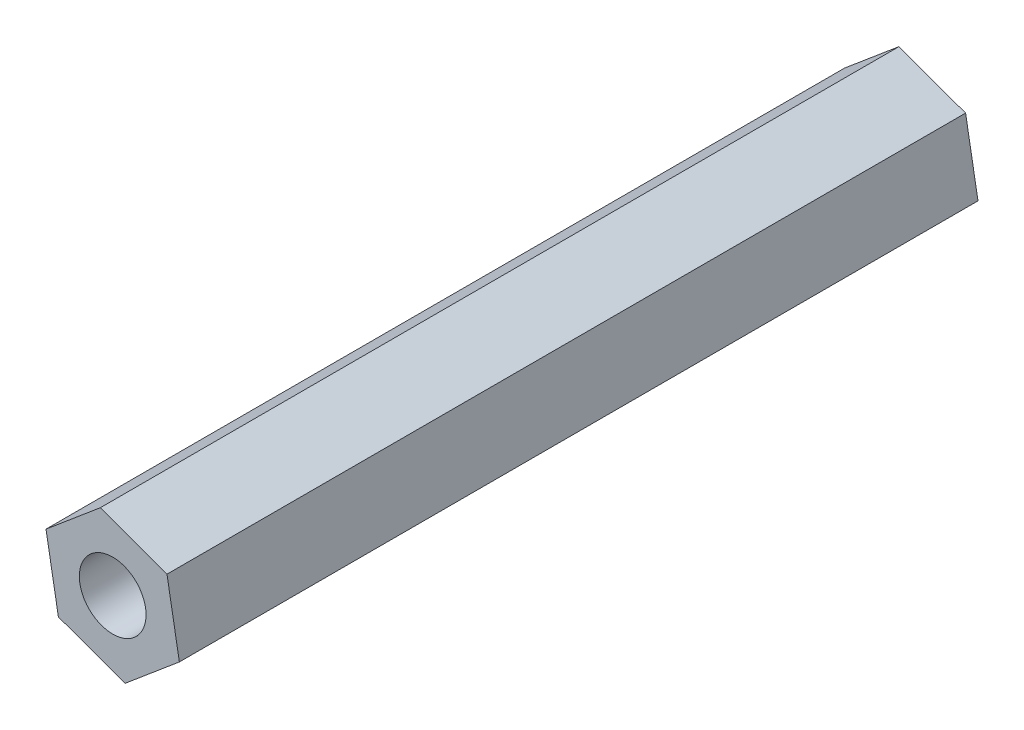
ISO-10303-21;
HEADER;
FILE_DESCRIPTION(('STEP AP214'),'2;1');
FILE_NAME('part.step','',(''),(''),'','','');
FILE_SCHEMA(('AUTOMOTIVE_DESIGN { 1 0 10303 214 1 1 1 1 }'));
ENDSEC;
DATA;
#1=APPLICATION_CONTEXT('core data for automotive mechanical design processes');
#2=APPLICATION_PROTOCOL_DEFINITION('international standard','automotive_design',2000,#1);
#3=PRODUCT_CONTEXT('',#1,'mechanical');
#4=PRODUCT('Part','Part','',(#3));
#5=PRODUCT_RELATED_PRODUCT_CATEGORY('part','',(#4));
#6=PRODUCT_DEFINITION_FORMATION('','',#4);
#7=PRODUCT_DEFINITION_CONTEXT('part definition',#1,'design');
#8=PRODUCT_DEFINITION('design','',#6,#7);
#9=PRODUCT_DEFINITION_SHAPE('','',#8);
#10=(LENGTH_UNIT() NAMED_UNIT(*) SI_UNIT(.MILLI.,.METRE.));
#11=(NAMED_UNIT(*) PLANE_ANGLE_UNIT() SI_UNIT($,.RADIAN.));
#12=(NAMED_UNIT(*) SI_UNIT($,.STERADIAN.) SOLID_ANGLE_UNIT());
#13=UNCERTAINTY_MEASURE_WITH_UNIT(LENGTH_MEASURE(1.E-05),#10,'distance_accuracy_value','');
#14=(GEOMETRIC_REPRESENTATION_CONTEXT(3) GLOBAL_UNCERTAINTY_ASSIGNED_CONTEXT((#13)) GLOBAL_UNIT_ASSIGNED_CONTEXT((#10,
#11,#12)) REPRESENTATION_CONTEXT('',''));
#15=CARTESIAN_POINT('',(0.,0.,0.));
#16=DIRECTION('',(0.,0.,1.));
#17=DIRECTION('',(1.,0.,0.));
#18=AXIS2_PLACEMENT_3D('',#15,#16,#17);
#19=CARTESIAN_POINT('',(0.640676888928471,-3.60975988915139,41.275));
#20=DIRECTION('',(-0.643647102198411,0.765322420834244,0.));
#21=DIRECTION('',(-0.765322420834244,-0.643647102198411,0.));
#22=AXIS2_PLACEMENT_3D('',#19,#20,#21);
#23=PLANE('',#22);
#24=DIRECTION('',(0.765322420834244,0.643647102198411,0.));
#25=VECTOR('',#24,1.);
#26=CARTESIAN_POINT('',(0.640676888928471,-3.60975988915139,0.));
#27=LINE('',#26,#25);
#28=CARTESIAN_POINT('',(0.640676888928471,-3.60975988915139,0.));
#29=VERTEX_POINT('',#28);
#30=CARTESIAN_POINT('',(3.44648221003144,-1.25003748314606,0.));
#31=VERTEX_POINT('',#30);
#32=EDGE_CURVE('E116',#29,#31,#27,.T.);
#33=ORIENTED_EDGE('',*,*,#32,.T.);
#34=DIRECTION('',(0.,0.,-1.));
#35=VECTOR('',#34,1.);
#36=CARTESIAN_POINT('',(3.44648221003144,-1.25003748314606,41.275));
#37=LINE('',#36,#35);
#38=CARTESIAN_POINT('',(3.44648221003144,-1.25003748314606,41.275));
#39=VERTEX_POINT('',#38);
#40=EDGE_CURVE('E11',#39,#31,#37,.T.);
#41=ORIENTED_EDGE('',*,*,#40,.F.);
#42=DIRECTION('',(0.765322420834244,0.643647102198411,0.));
#43=VECTOR('',#42,1.);
#44=CARTESIAN_POINT('',(0.640676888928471,-3.60975988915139,41.275));
#45=LINE('',#44,#43);
#46=CARTESIAN_POINT('',(0.640676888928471,-3.60975988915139,41.275));
#47=VERTEX_POINT('',#46);
#48=EDGE_CURVE('E127',#47,#39,#45,.T.);
#49=ORIENTED_EDGE('',*,*,#48,.F.);
#50=DIRECTION('',(0.,0.,-1.));
#51=VECTOR('',#50,1.);
#52=CARTESIAN_POINT('',(0.640676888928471,-3.60975988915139,41.275));
#53=LINE('',#52,#51);
#54=EDGE_CURVE('E112',#47,#29,#53,.T.);
#55=ORIENTED_EDGE('',*,*,#54,.T.);
#56=EDGE_LOOP('',(#33,#41,#49,#55));
#57=FACE_BOUND('',#56,.T.);
#58=ADVANCED_FACE('F32',(#57),#23,.F.);
#59=CARTESIAN_POINT('',(3.44648221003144,-1.25003748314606,41.275));
#60=DIRECTION('',(-0.984612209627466,-0.174753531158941,0.));
#61=DIRECTION('',(0.174753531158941,-0.984612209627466,0.));
#62=AXIS2_PLACEMENT_3D('',#59,#60,#61);
#63=PLANE('',#62);
#64=DIRECTION('',(-0.174753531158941,0.984612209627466,0.));
#65=VECTOR('',#64,1.);
#66=CARTESIAN_POINT('',(3.44648221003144,-1.25003748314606,0.));
#67=LINE('',#66,#65);
#68=CARTESIAN_POINT('',(2.80580532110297,2.35972240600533,0.));
#69=VERTEX_POINT('',#68);
#70=EDGE_CURVE('E119',#31,#69,#67,.T.);
#71=ORIENTED_EDGE('',*,*,#70,.T.);
#72=DIRECTION('',(0.,0.,-1.));
#73=VECTOR('',#72,1.);
#74=CARTESIAN_POINT('',(2.80580532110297,2.35972240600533,41.275));
#75=LINE('',#74,#73);
#76=CARTESIAN_POINT('',(2.80580532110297,2.35972240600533,41.275));
#77=VERTEX_POINT('',#76);
#78=EDGE_CURVE('E40',#77,#69,#75,.T.);
#79=ORIENTED_EDGE('',*,*,#78,.F.);
#80=DIRECTION('',(-0.174753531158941,0.984612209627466,0.));
#81=VECTOR('',#80,1.);
#82=CARTESIAN_POINT('',(3.44648221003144,-1.25003748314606,41.275));
#83=LINE('',#82,#81);
#84=EDGE_CURVE('E85',#39,#77,#83,.T.);
#85=ORIENTED_EDGE('',*,*,#84,.F.);
#86=ORIENTED_EDGE('',*,*,#40,.T.);
#87=EDGE_LOOP('',(#71,#79,#85,#86));
#88=FACE_BOUND('',#87,.T.);
#89=ADVANCED_FACE('F152',(#88),#63,.F.);
#90=CARTESIAN_POINT('',(2.80580532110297,2.35972240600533,41.275));
#91=DIRECTION('',(-0.340965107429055,-0.940075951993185,0.));
#92=DIRECTION('',(0.940075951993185,-0.340965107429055,0.));
#93=AXIS2_PLACEMENT_3D('',#90,#91,#92);
#94=PLANE('',#93);
#95=DIRECTION('',(-0.940075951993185,0.340965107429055,0.));
#96=VECTOR('',#95,1.);
#97=CARTESIAN_POINT('',(2.80580532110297,2.35972240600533,0.));
#98=LINE('',#97,#96);
#99=CARTESIAN_POINT('',(-0.64067688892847,3.60975988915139,0.));
#100=VERTEX_POINT('',#99);
#101=EDGE_CURVE('E122',#69,#100,#98,.T.);
#102=ORIENTED_EDGE('',*,*,#101,.T.);
#103=DIRECTION('',(0.,0.,-1.));
#104=VECTOR('',#103,1.);
#105=CARTESIAN_POINT('',(-0.64067688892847,3.60975988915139,41.275));
#106=LINE('',#105,#104);
#107=CARTESIAN_POINT('',(-0.64067688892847,3.60975988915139,41.275));
#108=VERTEX_POINT('',#107);
#109=EDGE_CURVE('E107',#108,#100,#106,.T.);
#110=ORIENTED_EDGE('',*,*,#109,.F.);
#111=DIRECTION('',(-0.940075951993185,0.340965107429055,0.));
#112=VECTOR('',#111,1.);
#113=CARTESIAN_POINT('',(2.80580532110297,2.35972240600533,41.275));
#114=LINE('',#113,#112);
#115=EDGE_CURVE('E98',#77,#108,#114,.T.);
#116=ORIENTED_EDGE('',*,*,#115,.F.);
#117=ORIENTED_EDGE('',*,*,#78,.T.);
#118=EDGE_LOOP('',(#102,#110,#116,#117));
#119=FACE_BOUND('',#118,.T.);
#120=ADVANCED_FACE('F133',(#119),#94,.F.);
#121=CARTESIAN_POINT('',(-0.64067688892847,3.60975988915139,41.275));
#122=DIRECTION('',(0.643647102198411,-0.765322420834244,0.));
#123=DIRECTION('',(0.765322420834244,0.643647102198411,0.));
#124=AXIS2_PLACEMENT_3D('',#121,#122,#123);
#125=PLANE('',#124);
#126=DIRECTION('',(-0.765322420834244,-0.643647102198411,0.));
#127=VECTOR('',#126,1.);
#128=CARTESIAN_POINT('',(-0.64067688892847,3.60975988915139,0.));
#129=LINE('',#128,#127);
#130=CARTESIAN_POINT('',(-3.44648221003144,1.25003748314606,0.));
#131=VERTEX_POINT('',#130);
#132=EDGE_CURVE('E106',#100,#131,#129,.T.);
#133=ORIENTED_EDGE('',*,*,#132,.T.);
#134=DIRECTION('',(0.,0.,-1.));
#135=VECTOR('',#134,1.);
#136=CARTESIAN_POINT('',(-3.44648221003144,1.25003748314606,41.275));
#137=LINE('',#136,#135);
#138=CARTESIAN_POINT('',(-3.44648221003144,1.25003748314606,41.275));
#139=VERTEX_POINT('',#138);
#140=EDGE_CURVE('E103',#139,#131,#137,.T.);
#141=ORIENTED_EDGE('',*,*,#140,.F.);
#142=DIRECTION('',(-0.765322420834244,-0.643647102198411,0.));
#143=VECTOR('',#142,1.);
#144=CARTESIAN_POINT('',(-0.64067688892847,3.60975988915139,41.275));
#145=LINE('',#144,#143);
#146=EDGE_CURVE('E92',#108,#139,#145,.T.);
#147=ORIENTED_EDGE('',*,*,#146,.F.);
#148=ORIENTED_EDGE('',*,*,#109,.T.);
#149=EDGE_LOOP('',(#133,#141,#147,#148));
#150=FACE_BOUND('',#149,.T.);
#151=ADVANCED_FACE('F104',(#150),#125,.F.);
#152=CARTESIAN_POINT('',(-3.44648221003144,1.25003748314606,41.275));
#153=DIRECTION('',(0.984612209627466,0.174753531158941,0.));
#154=DIRECTION('',(-0.174753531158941,0.984612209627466,0.));
#155=AXIS2_PLACEMENT_3D('',#152,#153,#154);
#156=PLANE('',#155);
#157=DIRECTION('',(0.174753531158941,-0.984612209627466,0.));
#158=VECTOR('',#157,1.);
#159=CARTESIAN_POINT('',(-3.44648221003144,1.25003748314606,0.));
#160=LINE('',#159,#158);
#161=CARTESIAN_POINT('',(-2.80580532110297,-2.35972240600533,0.));
#162=VERTEX_POINT('',#161);
#163=EDGE_CURVE('E71',#131,#162,#160,.T.);
#164=ORIENTED_EDGE('',*,*,#163,.T.);
#165=DIRECTION('',(0.,0.,-1.));
#166=VECTOR('',#165,1.);
#167=CARTESIAN_POINT('',(-2.80580532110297,-2.35972240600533,41.275));
#168=LINE('',#167,#166);
#169=CARTESIAN_POINT('',(-2.80580532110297,-2.35972240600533,41.275));
#170=VERTEX_POINT('',#169);
#171=EDGE_CURVE('E108',#170,#162,#168,.T.);
#172=ORIENTED_EDGE('',*,*,#171,.F.);
#173=DIRECTION('',(0.174753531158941,-0.984612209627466,0.));
#174=VECTOR('',#173,1.);
#175=CARTESIAN_POINT('',(-3.44648221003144,1.25003748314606,41.275));
#176=LINE('',#175,#174);
#177=EDGE_CURVE('E96',#139,#170,#176,.T.);
#178=ORIENTED_EDGE('',*,*,#177,.F.);
#179=ORIENTED_EDGE('',*,*,#140,.T.);
#180=EDGE_LOOP('',(#164,#172,#178,#179));
#181=FACE_BOUND('',#180,.T.);
#182=ADVANCED_FACE('F110',(#181),#156,.F.);
#183=CARTESIAN_POINT('',(-2.80580532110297,-2.35972240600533,41.275));
#184=DIRECTION('',(0.340965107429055,0.940075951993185,0.));
#185=DIRECTION('',(-0.940075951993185,0.340965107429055,0.));
#186=AXIS2_PLACEMENT_3D('',#183,#184,#185);
#187=PLANE('',#186);
#188=DIRECTION('',(0.940075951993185,-0.340965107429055,0.));
#189=VECTOR('',#188,1.);
#190=CARTESIAN_POINT('',(-2.80580532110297,-2.35972240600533,0.));
#191=LINE('',#190,#189);
#192=EDGE_CURVE('E77',#162,#29,#191,.T.);
#193=ORIENTED_EDGE('',*,*,#192,.T.);
#194=ORIENTED_EDGE('',*,*,#54,.F.);
#195=DIRECTION('',(0.940075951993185,-0.340965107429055,0.));
#196=VECTOR('',#195,1.);
#197=CARTESIAN_POINT('',(-2.80580532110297,-2.35972240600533,41.275));
#198=LINE('',#197,#196);
#199=EDGE_CURVE('E48',#170,#47,#198,.T.);
#200=ORIENTED_EDGE('',*,*,#199,.F.);
#201=ORIENTED_EDGE('',*,*,#171,.T.);
#202=EDGE_LOOP('',(#193,#194,#200,#201));
#203=FACE_BOUND('',#202,.T.);
#204=ADVANCED_FACE('F140',(#203),#187,.F.);
#205=CARTESIAN_POINT('',(0.,0.,41.275));
#206=DIRECTION('',(0.,0.,1.));
#207=DIRECTION('',(1.,0.,0.));
#208=AXIS2_PLACEMENT_3D('',#205,#206,#207);
#209=PLANE('',#208);
#210=CARTESIAN_POINT('',(0.,0.,41.275));
#211=DIRECTION('',(0.,0.,1.));
#212=DIRECTION('',(1.,0.,0.));
#213=AXIS2_PLACEMENT_3D('',#210,#211,#212);
#214=CIRCLE('',#213,1.72421426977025);
#215=CARTESIAN_POINT('',(1.72421426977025,0.,41.275));
#216=VERTEX_POINT('',#215);
#217=EDGE_CURVE('E207',#216,#216,#214,.T.);
#218=ORIENTED_EDGE('',*,*,#217,.F.);
#219=EDGE_LOOP('',(#218));
#220=FACE_BOUND('',#219,.T.);
#221=ORIENTED_EDGE('',*,*,#48,.T.);
#222=ORIENTED_EDGE('',*,*,#84,.T.);
#223=ORIENTED_EDGE('',*,*,#115,.T.);
#224=ORIENTED_EDGE('',*,*,#146,.T.);
#225=ORIENTED_EDGE('',*,*,#177,.T.);
#226=ORIENTED_EDGE('',*,*,#199,.T.);
#227=EDGE_LOOP('',(#221,#222,#223,#224,#225,#226));
#228=FACE_BOUND('',#227,.T.);
#229=ADVANCED_FACE('F94',(#220,#228),#209,.T.);
#230=CARTESIAN_POINT('',(0.,0.,0.));
#231=DIRECTION('',(0.,0.,1.));
#232=DIRECTION('',(1.,0.,0.));
#233=AXIS2_PLACEMENT_3D('',#230,#231,#232);
#234=PLANE('',#233);
#235=CARTESIAN_POINT('',(0.,0.,0.));
#236=DIRECTION('',(0.,0.,1.));
#237=DIRECTION('',(1.,0.,0.));
#238=AXIS2_PLACEMENT_3D('',#235,#236,#237);
#239=CIRCLE('',#238,1.72421426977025);
#240=CARTESIAN_POINT('',(1.72421426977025,0.,0.));
#241=VERTEX_POINT('',#240);
#242=EDGE_CURVE('E120',#241,#241,#239,.T.);
#243=ORIENTED_EDGE('',*,*,#242,.T.);
#244=EDGE_LOOP('',(#243));
#245=FACE_BOUND('',#244,.T.);
#246=ORIENTED_EDGE('',*,*,#32,.F.);
#247=ORIENTED_EDGE('',*,*,#192,.F.);
#248=ORIENTED_EDGE('',*,*,#163,.F.);
#249=ORIENTED_EDGE('',*,*,#132,.F.);
#250=ORIENTED_EDGE('',*,*,#101,.F.);
#251=ORIENTED_EDGE('',*,*,#70,.F.);
#252=EDGE_LOOP('',(#246,#247,#248,#249,#250,#251));
#253=FACE_BOUND('',#252,.T.);
#254=ADVANCED_FACE('F136',(#245,#253),#234,.F.);
#255=CARTESIAN_POINT('',(0.,0.,0.));
#256=DIRECTION('',(0.,0.,1.));
#257=DIRECTION('',(1.,0.,0.));
#258=AXIS2_PLACEMENT_3D('',#255,#256,#257);
#259=CYLINDRICAL_SURFACE('',#258,1.72421426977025);
#260=ORIENTED_EDGE('',*,*,#242,.F.);
#261=EDGE_LOOP('',(#260));
#262=FACE_BOUND('',#261,.T.);
#263=ORIENTED_EDGE('',*,*,#217,.T.);
#264=EDGE_LOOP('',(#263));
#265=FACE_BOUND('',#264,.T.);
#266=ADVANCED_FACE('F189',(#262,#265),#259,.F.);
#267=CLOSED_SHELL('',(#58,#89,#120,#151,#182,#204,#229,#254,#266));
#268=MANIFOLD_SOLID_BREP('B2',#267);
#269=ADVANCED_BREP_SHAPE_REPRESENTATION('',(#18,#268),#14);
#270=SHAPE_DEFINITION_REPRESENTATION(#9,#269);
ENDSEC;
END-ISO-10303-21;
